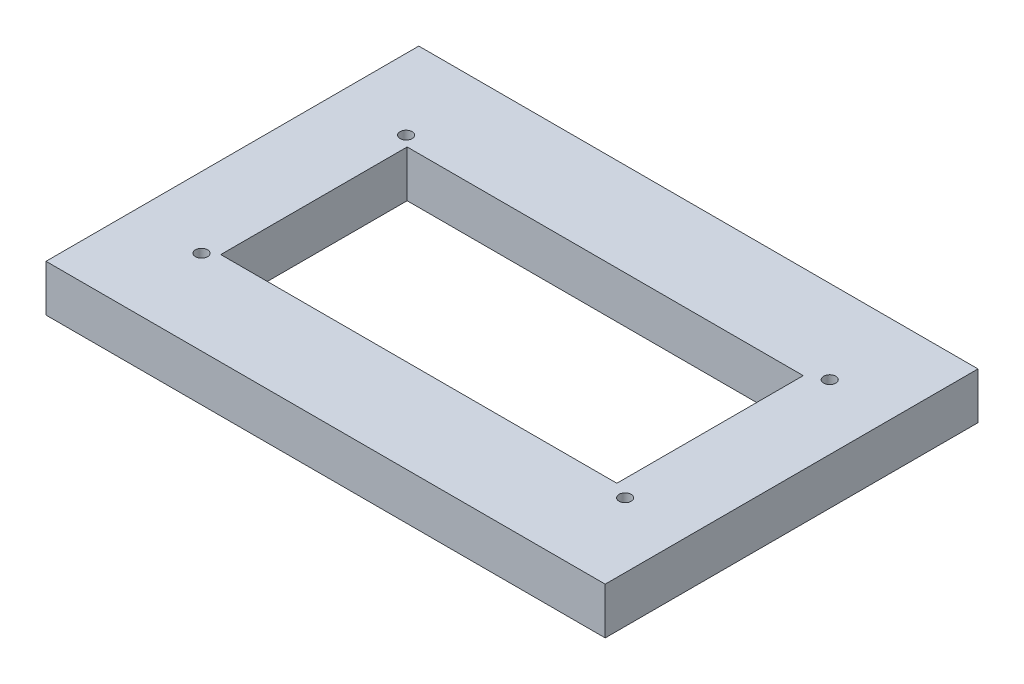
ISO-10303-21;
HEADER;
FILE_DESCRIPTION(('STEP AP214'),'2;1');
FILE_NAME('part.step','',(''),(''),'','','');
FILE_SCHEMA(('AUTOMOTIVE_DESIGN { 1 0 10303 214 1 1 1 1 }'));
ENDSEC;
DATA;
#1=APPLICATION_CONTEXT('core data for automotive mechanical design processes');
#2=APPLICATION_PROTOCOL_DEFINITION('international standard','automotive_design',2000,#1);
#3=PRODUCT_CONTEXT('',#1,'mechanical');
#4=PRODUCT('Part','Part','',(#3));
#5=PRODUCT_RELATED_PRODUCT_CATEGORY('part','',(#4));
#6=PRODUCT_DEFINITION_FORMATION('','',#4);
#7=PRODUCT_DEFINITION_CONTEXT('part definition',#1,'design');
#8=PRODUCT_DEFINITION('design','',#6,#7);
#9=PRODUCT_DEFINITION_SHAPE('','',#8);
#10=(LENGTH_UNIT() NAMED_UNIT(*) SI_UNIT(.MILLI.,.METRE.));
#11=(NAMED_UNIT(*) PLANE_ANGLE_UNIT() SI_UNIT($,.RADIAN.));
#12=(NAMED_UNIT(*) SI_UNIT($,.STERADIAN.) SOLID_ANGLE_UNIT());
#13=UNCERTAINTY_MEASURE_WITH_UNIT(LENGTH_MEASURE(1.E-05),#10,'distance_accuracy_value','');
#14=(GEOMETRIC_REPRESENTATION_CONTEXT(3) GLOBAL_UNCERTAINTY_ASSIGNED_CONTEXT((#13)) GLOBAL_UNIT_ASSIGNED_CONTEXT((#10,
#11,#12)) REPRESENTATION_CONTEXT('',''));
#15=CARTESIAN_POINT('',(0.,0.,0.));
#16=DIRECTION('',(0.,0.,1.));
#17=DIRECTION('',(1.,0.,0.));
#18=AXIS2_PLACEMENT_3D('',#15,#16,#17);
#19=CARTESIAN_POINT('',(152.4,25.4,-101.6));
#20=DIRECTION('',(-1.,0.,0.));
#21=DIRECTION('',(0.,0.,1.));
#22=AXIS2_PLACEMENT_3D('',#19,#20,#21);
#23=PLANE('',#22);
#24=DIRECTION('',(0.,0.,-1.));
#25=VECTOR('',#24,1.);
#26=CARTESIAN_POINT('',(152.4,0.,-101.6));
#27=LINE('',#26,#25);
#28=CARTESIAN_POINT('',(152.4,0.,101.6));
#29=VERTEX_POINT('',#28);
#30=CARTESIAN_POINT('',(152.4,0.,-101.6));
#31=VERTEX_POINT('',#30);
#32=EDGE_CURVE('E134',#29,#31,#27,.T.);
#33=ORIENTED_EDGE('',*,*,#32,.T.);
#34=DIRECTION('',(0.,-1.,0.));
#35=VECTOR('',#34,1.);
#36=CARTESIAN_POINT('',(152.4,25.4,-101.6));
#37=LINE('',#36,#35);
#38=CARTESIAN_POINT('',(152.4,25.4,-101.6));
#39=VERTEX_POINT('',#38);
#40=EDGE_CURVE('E11',#39,#31,#37,.T.);
#41=ORIENTED_EDGE('',*,*,#40,.F.);
#42=DIRECTION('',(0.,0.,-1.));
#43=VECTOR('',#42,1.);
#44=CARTESIAN_POINT('',(152.4,25.4,-101.6));
#45=LINE('',#44,#43);
#46=CARTESIAN_POINT('',(152.4,25.4,101.6));
#47=VERTEX_POINT('',#46);
#48=EDGE_CURVE('E138',#47,#39,#45,.T.);
#49=ORIENTED_EDGE('',*,*,#48,.F.);
#50=DIRECTION('',(0.,-1.,0.));
#51=VECTOR('',#50,1.);
#52=CARTESIAN_POINT('',(152.4,25.4,101.6));
#53=LINE('',#52,#51);
#54=EDGE_CURVE('E148',#47,#29,#53,.T.);
#55=ORIENTED_EDGE('',*,*,#54,.T.);
#56=EDGE_LOOP('',(#33,#41,#49,#55));
#57=FACE_BOUND('',#56,.T.);
#58=ADVANCED_FACE('F33',(#57),#23,.F.);
#59=CARTESIAN_POINT('',(-152.4,25.4,-101.6));
#60=DIRECTION('',(0.,0.,1.));
#61=DIRECTION('',(1.,0.,0.));
#62=AXIS2_PLACEMENT_3D('',#59,#60,#61);
#63=PLANE('',#62);
#64=DIRECTION('',(-1.,0.,0.));
#65=VECTOR('',#64,1.);
#66=CARTESIAN_POINT('',(-152.4,0.,-101.6));
#67=LINE('',#66,#65);
#68=CARTESIAN_POINT('',(-152.4,0.,-101.6));
#69=VERTEX_POINT('',#68);
#70=EDGE_CURVE('E151',#31,#69,#67,.T.);
#71=ORIENTED_EDGE('',*,*,#70,.T.);
#72=DIRECTION('',(0.,-1.,0.));
#73=VECTOR('',#72,1.);
#74=CARTESIAN_POINT('',(-152.4,25.4,-101.6));
#75=LINE('',#74,#73);
#76=CARTESIAN_POINT('',(-152.4,25.4,-101.6));
#77=VERTEX_POINT('',#76);
#78=EDGE_CURVE('E40',#77,#69,#75,.T.);
#79=ORIENTED_EDGE('',*,*,#78,.F.);
#80=DIRECTION('',(-1.,0.,0.));
#81=VECTOR('',#80,1.);
#82=CARTESIAN_POINT('',(-152.4,25.4,-101.6));
#83=LINE('',#82,#81);
#84=EDGE_CURVE('E141',#39,#77,#83,.T.);
#85=ORIENTED_EDGE('',*,*,#84,.F.);
#86=ORIENTED_EDGE('',*,*,#40,.T.);
#87=EDGE_LOOP('',(#71,#79,#85,#86));
#88=FACE_BOUND('',#87,.T.);
#89=ADVANCED_FACE('F179',(#88),#63,.F.);
#90=CARTESIAN_POINT('',(-152.4,25.4,-101.6));
#91=DIRECTION('',(1.,0.,0.));
#92=DIRECTION('',(0.,0.,-1.));
#93=AXIS2_PLACEMENT_3D('',#90,#91,#92);
#94=PLANE('',#93);
#95=DIRECTION('',(0.,0.,1.));
#96=VECTOR('',#95,1.);
#97=CARTESIAN_POINT('',(-152.4,0.,-101.6));
#98=LINE('',#97,#96);
#99=CARTESIAN_POINT('',(-152.4,0.,101.6));
#100=VERTEX_POINT('',#99);
#101=EDGE_CURVE('E153',#69,#100,#98,.T.);
#102=ORIENTED_EDGE('',*,*,#101,.T.);
#103=DIRECTION('',(0.,-1.,0.));
#104=VECTOR('',#103,1.);
#105=CARTESIAN_POINT('',(-152.4,25.4,101.6));
#106=LINE('',#105,#104);
#107=CARTESIAN_POINT('',(-152.4,25.4,101.6));
#108=VERTEX_POINT('',#107);
#109=EDGE_CURVE('E158',#108,#100,#106,.T.);
#110=ORIENTED_EDGE('',*,*,#109,.F.);
#111=DIRECTION('',(0.,0.,1.));
#112=VECTOR('',#111,1.);
#113=CARTESIAN_POINT('',(-152.4,25.4,-101.6));
#114=LINE('',#113,#112);
#115=EDGE_CURVE('E144',#77,#108,#114,.T.);
#116=ORIENTED_EDGE('',*,*,#115,.F.);
#117=ORIENTED_EDGE('',*,*,#78,.T.);
#118=EDGE_LOOP('',(#102,#110,#116,#117));
#119=FACE_BOUND('',#118,.T.);
#120=ADVANCED_FACE('F165',(#119),#94,.F.);
#121=CARTESIAN_POINT('',(-152.4,25.4,101.6));
#122=DIRECTION('',(0.,0.,-1.));
#123=DIRECTION('',(-1.,0.,0.));
#124=AXIS2_PLACEMENT_3D('',#121,#122,#123);
#125=PLANE('',#124);
#126=DIRECTION('',(1.,0.,0.));
#127=VECTOR('',#126,1.);
#128=CARTESIAN_POINT('',(-152.4,0.,101.6));
#129=LINE('',#128,#127);
#130=EDGE_CURVE('E142',#100,#29,#129,.T.);
#131=ORIENTED_EDGE('',*,*,#130,.T.);
#132=ORIENTED_EDGE('',*,*,#54,.F.);
#133=DIRECTION('',(1.,0.,0.));
#134=VECTOR('',#133,1.);
#135=CARTESIAN_POINT('',(-152.4,25.4,101.6));
#136=LINE('',#135,#134);
#137=EDGE_CURVE('E146',#108,#47,#136,.T.);
#138=ORIENTED_EDGE('',*,*,#137,.F.);
#139=ORIENTED_EDGE('',*,*,#109,.T.);
#140=EDGE_LOOP('',(#131,#132,#138,#139));
#141=FACE_BOUND('',#140,.T.);
#142=ADVANCED_FACE('F172',(#141),#125,.F.);
#143=CARTESIAN_POINT('',(0.,25.4,0.));
#144=DIRECTION('',(0.,1.,0.));
#145=DIRECTION('',(0.,0.,1.));
#146=AXIS2_PLACEMENT_3D('',#143,#144,#145);
#147=PLANE('',#146);
#148=CARTESIAN_POINT('',(117.071822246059,25.4,-56.1041996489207));
#149=DIRECTION('',(0.,1.,0.));
#150=DIRECTION('',(0.,0.,1.));
#151=AXIS2_PLACEMENT_3D('',#148,#149,#150);
#152=CIRCLE('',#151,3.3);
#153=CARTESIAN_POINT('',(117.071822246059,25.4,-52.8041996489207));
#154=VERTEX_POINT('',#153);
#155=EDGE_CURVE('E229',#154,#154,#152,.T.);
#156=ORIENTED_EDGE('',*,*,#155,.F.);
#157=EDGE_LOOP('',(#156));
#158=FACE_BOUND('',#157,.T.);
#159=CARTESIAN_POINT('',(117.071822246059,25.4,55.4092570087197));
#160=DIRECTION('',(0.,1.,0.));
#161=DIRECTION('',(0.,0.,1.));
#162=AXIS2_PLACEMENT_3D('',#159,#160,#161);
#163=CIRCLE('',#162,3.3);
#164=CARTESIAN_POINT('',(117.071822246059,25.4,58.7092570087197));
#165=VERTEX_POINT('',#164);
#166=EDGE_CURVE('E231',#165,#165,#163,.T.);
#167=ORIENTED_EDGE('',*,*,#166,.F.);
#168=EDGE_LOOP('',(#167));
#169=FACE_BOUND('',#168,.T.);
#170=CARTESIAN_POINT('',(-113.812107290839,25.4,55.4092570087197));
#171=DIRECTION('',(0.,1.,0.));
#172=DIRECTION('',(0.,0.,1.));
#173=AXIS2_PLACEMENT_3D('',#170,#171,#172);
#174=CIRCLE('',#173,3.30000000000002);
#175=CARTESIAN_POINT('',(-113.812107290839,25.4,58.7092570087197));
#176=VERTEX_POINT('',#175);
#177=EDGE_CURVE('E237',#176,#176,#174,.T.);
#178=ORIENTED_EDGE('',*,*,#177,.F.);
#179=EDGE_LOOP('',(#178));
#180=FACE_BOUND('',#179,.T.);
#181=CARTESIAN_POINT('',(-113.812107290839,25.4,-56.1041996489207));
#182=DIRECTION('',(0.,1.,0.));
#183=DIRECTION('',(0.,0.,1.));
#184=AXIS2_PLACEMENT_3D('',#181,#182,#183);
#185=CIRCLE('',#184,3.30000000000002);
#186=CARTESIAN_POINT('',(-113.812107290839,25.4,-52.8041996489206));
#187=VERTEX_POINT('',#186);
#188=EDGE_CURVE('E121',#187,#187,#185,.T.);
#189=ORIENTED_EDGE('',*,*,#188,.F.);
#190=EDGE_LOOP('',(#189));
#191=FACE_BOUND('',#190,.T.);
#192=DIRECTION('',(0.,0.,-1.));
#193=VECTOR('',#192,1.);
#194=CARTESIAN_POINT('',(107.95,25.4,-50.8));
#195=LINE('',#194,#193);
#196=CARTESIAN_POINT('',(107.95,25.4,50.8));
#197=VERTEX_POINT('',#196);
#198=CARTESIAN_POINT('',(107.95,25.4,-50.8));
#199=VERTEX_POINT('',#198);
#200=EDGE_CURVE('E47',#197,#199,#195,.T.);
#201=ORIENTED_EDGE('',*,*,#200,.F.);
#202=DIRECTION('',(1.,0.,0.));
#203=VECTOR('',#202,1.);
#204=CARTESIAN_POINT('',(-107.95,25.4,50.8));
#205=LINE('',#204,#203);
#206=CARTESIAN_POINT('',(-107.95,25.4,50.8));
#207=VERTEX_POINT('',#206);
#208=EDGE_CURVE('E115',#207,#197,#205,.T.);
#209=ORIENTED_EDGE('',*,*,#208,.F.);
#210=DIRECTION('',(0.,0.,1.));
#211=VECTOR('',#210,1.);
#212=CARTESIAN_POINT('',(-107.95,25.4,-50.8));
#213=LINE('',#212,#211);
#214=CARTESIAN_POINT('',(-107.95,25.4,-50.8));
#215=VERTEX_POINT('',#214);
#216=EDGE_CURVE('E118',#215,#207,#213,.T.);
#217=ORIENTED_EDGE('',*,*,#216,.F.);
#218=DIRECTION('',(-1.,0.,0.));
#219=VECTOR('',#218,1.);
#220=CARTESIAN_POINT('',(-107.95,25.4,-50.8));
#221=LINE('',#220,#219);
#222=EDGE_CURVE('E127',#199,#215,#221,.T.);
#223=ORIENTED_EDGE('',*,*,#222,.F.);
#224=EDGE_LOOP('',(#201,#209,#217,#223));
#225=FACE_BOUND('',#224,.T.);
#226=ORIENTED_EDGE('',*,*,#48,.T.);
#227=ORIENTED_EDGE('',*,*,#84,.T.);
#228=ORIENTED_EDGE('',*,*,#115,.T.);
#229=ORIENTED_EDGE('',*,*,#137,.T.);
#230=EDGE_LOOP('',(#226,#227,#228,#229));
#231=FACE_BOUND('',#230,.T.);
#232=ADVANCED_FACE('F178',(#158,#169,#180,#191,#225,#231),#147,.T.);
#233=CARTESIAN_POINT('',(0.,0.,0.));
#234=DIRECTION('',(0.,1.,0.));
#235=DIRECTION('',(0.,0.,1.));
#236=AXIS2_PLACEMENT_3D('',#233,#234,#235);
#237=PLANE('',#236);
#238=CARTESIAN_POINT('',(117.071822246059,0.,-56.1041996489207));
#239=DIRECTION('',(0.,1.,0.));
#240=DIRECTION('',(0.,0.,1.));
#241=AXIS2_PLACEMENT_3D('',#238,#239,#240);
#242=CIRCLE('',#241,3.3);
#243=CARTESIAN_POINT('',(117.071822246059,0.,-52.8041996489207));
#244=VERTEX_POINT('',#243);
#245=EDGE_CURVE('E226',#244,#244,#242,.T.);
#246=ORIENTED_EDGE('',*,*,#245,.T.);
#247=EDGE_LOOP('',(#246));
#248=FACE_BOUND('',#247,.T.);
#249=CARTESIAN_POINT('',(117.071822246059,0.,55.4092570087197));
#250=DIRECTION('',(0.,1.,0.));
#251=DIRECTION('',(0.,0.,1.));
#252=AXIS2_PLACEMENT_3D('',#249,#250,#251);
#253=CIRCLE('',#252,3.3);
#254=CARTESIAN_POINT('',(117.071822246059,0.,58.7092570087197));
#255=VERTEX_POINT('',#254);
#256=EDGE_CURVE('E234',#255,#255,#253,.T.);
#257=ORIENTED_EDGE('',*,*,#256,.T.);
#258=EDGE_LOOP('',(#257));
#259=FACE_BOUND('',#258,.T.);
#260=CARTESIAN_POINT('',(-113.812107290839,0.,55.4092570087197));
#261=DIRECTION('',(0.,1.,0.));
#262=DIRECTION('',(0.,0.,1.));
#263=AXIS2_PLACEMENT_3D('',#260,#261,#262);
#264=CIRCLE('',#263,3.30000000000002);
#265=CARTESIAN_POINT('',(-113.812107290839,0.,58.7092570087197));
#266=VERTEX_POINT('',#265);
#267=EDGE_CURVE('E240',#266,#266,#264,.T.);
#268=ORIENTED_EDGE('',*,*,#267,.T.);
#269=EDGE_LOOP('',(#268));
#270=FACE_BOUND('',#269,.T.);
#271=CARTESIAN_POINT('',(-113.812107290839,0.,-56.1041996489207));
#272=DIRECTION('',(0.,1.,0.));
#273=DIRECTION('',(0.,0.,1.));
#274=AXIS2_PLACEMENT_3D('',#271,#272,#273);
#275=CIRCLE('',#274,3.30000000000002);
#276=CARTESIAN_POINT('',(-113.812107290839,0.,-52.8041996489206));
#277=VERTEX_POINT('',#276);
#278=EDGE_CURVE('E128',#277,#277,#275,.T.);
#279=ORIENTED_EDGE('',*,*,#278,.T.);
#280=EDGE_LOOP('',(#279));
#281=FACE_BOUND('',#280,.T.);
#282=DIRECTION('',(1.,0.,0.));
#283=VECTOR('',#282,1.);
#284=CARTESIAN_POINT('',(-107.95,0.,50.8));
#285=LINE('',#284,#283);
#286=CARTESIAN_POINT('',(-107.95,0.,50.8));
#287=VERTEX_POINT('',#286);
#288=CARTESIAN_POINT('',(107.95,0.,50.8));
#289=VERTEX_POINT('',#288);
#290=EDGE_CURVE('E105',#287,#289,#285,.T.);
#291=ORIENTED_EDGE('',*,*,#290,.T.);
#292=DIRECTION('',(0.,0.,-1.));
#293=VECTOR('',#292,1.);
#294=CARTESIAN_POINT('',(107.95,0.,-50.8));
#295=LINE('',#294,#293);
#296=CARTESIAN_POINT('',(107.95,0.,-50.8));
#297=VERTEX_POINT('',#296);
#298=EDGE_CURVE('E99',#289,#297,#295,.T.);
#299=ORIENTED_EDGE('',*,*,#298,.T.);
#300=DIRECTION('',(-1.,0.,0.));
#301=VECTOR('',#300,1.);
#302=CARTESIAN_POINT('',(-107.95,0.,-50.8));
#303=LINE('',#302,#301);
#304=CARTESIAN_POINT('',(-107.95,0.,-50.8));
#305=VERTEX_POINT('',#304);
#306=EDGE_CURVE('E108',#297,#305,#303,.T.);
#307=ORIENTED_EDGE('',*,*,#306,.T.);
#308=DIRECTION('',(0.,0.,1.));
#309=VECTOR('',#308,1.);
#310=CARTESIAN_POINT('',(-107.95,0.,-50.8));
#311=LINE('',#310,#309);
#312=EDGE_CURVE('E55',#305,#287,#311,.T.);
#313=ORIENTED_EDGE('',*,*,#312,.T.);
#314=EDGE_LOOP('',(#291,#299,#307,#313));
#315=FACE_BOUND('',#314,.T.);
#316=ORIENTED_EDGE('',*,*,#32,.F.);
#317=ORIENTED_EDGE('',*,*,#130,.F.);
#318=ORIENTED_EDGE('',*,*,#101,.F.);
#319=ORIENTED_EDGE('',*,*,#70,.F.);
#320=EDGE_LOOP('',(#316,#317,#318,#319));
#321=FACE_BOUND('',#320,.T.);
#322=ADVANCED_FACE('F112',(#248,#259,#270,#281,#315,#321),#237,.F.);
#323=CARTESIAN_POINT('',(107.95,0.,-50.8));
#324=DIRECTION('',(1.,0.,0.));
#325=DIRECTION('',(0.,0.,-1.));
#326=AXIS2_PLACEMENT_3D('',#323,#324,#325);
#327=PLANE('',#326);
#328=ORIENTED_EDGE('',*,*,#200,.T.);
#329=DIRECTION('',(0.,1.,0.));
#330=VECTOR('',#329,1.);
#331=CARTESIAN_POINT('',(107.95,0.,-50.8));
#332=LINE('',#331,#330);
#333=EDGE_CURVE('E95',#297,#199,#332,.T.);
#334=ORIENTED_EDGE('',*,*,#333,.F.);
#335=ORIENTED_EDGE('',*,*,#298,.F.);
#336=DIRECTION('',(0.,1.,0.));
#337=VECTOR('',#336,1.);
#338=CARTESIAN_POINT('',(107.95,0.,50.8));
#339=LINE('',#338,#337);
#340=EDGE_CURVE('E132',#289,#197,#339,.T.);
#341=ORIENTED_EDGE('',*,*,#340,.T.);
#342=EDGE_LOOP('',(#328,#334,#335,#341));
#343=FACE_BOUND('',#342,.T.);
#344=ADVANCED_FACE('F97',(#343),#327,.F.);
#345=CARTESIAN_POINT('',(-107.95,0.,50.8));
#346=DIRECTION('',(0.,0.,1.));
#347=DIRECTION('',(1.,0.,0.));
#348=AXIS2_PLACEMENT_3D('',#345,#346,#347);
#349=PLANE('',#348);
#350=ORIENTED_EDGE('',*,*,#208,.T.);
#351=ORIENTED_EDGE('',*,*,#340,.F.);
#352=ORIENTED_EDGE('',*,*,#290,.F.);
#353=DIRECTION('',(0.,1.,0.));
#354=VECTOR('',#353,1.);
#355=CARTESIAN_POINT('',(-107.95,0.,50.8));
#356=LINE('',#355,#354);
#357=EDGE_CURVE('E135',#287,#207,#356,.T.);
#358=ORIENTED_EDGE('',*,*,#357,.T.);
#359=EDGE_LOOP('',(#350,#351,#352,#358));
#360=FACE_BOUND('',#359,.T.);
#361=ADVANCED_FACE('F197',(#360),#349,.F.);
#362=CARTESIAN_POINT('',(-107.95,0.,-50.8));
#363=DIRECTION('',(-1.,0.,0.));
#364=DIRECTION('',(0.,0.,1.));
#365=AXIS2_PLACEMENT_3D('',#362,#363,#364);
#366=PLANE('',#365);
#367=ORIENTED_EDGE('',*,*,#216,.T.);
#368=ORIENTED_EDGE('',*,*,#357,.F.);
#369=ORIENTED_EDGE('',*,*,#312,.F.);
#370=DIRECTION('',(0.,1.,0.));
#371=VECTOR('',#370,1.);
#372=CARTESIAN_POINT('',(-107.95,0.,-50.8));
#373=LINE('',#372,#371);
#374=EDGE_CURVE('E104',#305,#215,#373,.T.);
#375=ORIENTED_EDGE('',*,*,#374,.T.);
#376=EDGE_LOOP('',(#367,#368,#369,#375));
#377=FACE_BOUND('',#376,.T.);
#378=ADVANCED_FACE('F201',(#377),#366,.F.);
#379=CARTESIAN_POINT('',(-107.95,0.,-50.8));
#380=DIRECTION('',(0.,0.,-1.));
#381=DIRECTION('',(-1.,0.,0.));
#382=AXIS2_PLACEMENT_3D('',#379,#380,#381);
#383=PLANE('',#382);
#384=ORIENTED_EDGE('',*,*,#222,.T.);
#385=ORIENTED_EDGE('',*,*,#374,.F.);
#386=ORIENTED_EDGE('',*,*,#306,.F.);
#387=ORIENTED_EDGE('',*,*,#333,.T.);
#388=EDGE_LOOP('',(#384,#385,#386,#387));
#389=FACE_BOUND('',#388,.T.);
#390=ADVANCED_FACE('F109',(#389),#383,.F.);
#391=CARTESIAN_POINT('',(-113.812107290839,0.,-56.1041996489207));
#392=DIRECTION('',(0.,1.,0.));
#393=DIRECTION('',(0.,0.,1.));
#394=AXIS2_PLACEMENT_3D('',#391,#392,#393);
#395=CYLINDRICAL_SURFACE('',#394,3.30000000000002);
#396=ORIENTED_EDGE('',*,*,#278,.F.);
#397=EDGE_LOOP('',(#396));
#398=FACE_BOUND('',#397,.T.);
#399=ORIENTED_EDGE('',*,*,#188,.T.);
#400=EDGE_LOOP('',(#399));
#401=FACE_BOUND('',#400,.T.);
#402=ADVANCED_FACE('F200',(#398,#401),#395,.F.);
#403=CARTESIAN_POINT('',(-113.812107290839,0.,55.4092570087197));
#404=DIRECTION('',(0.,1.,0.));
#405=DIRECTION('',(0.,0.,1.));
#406=AXIS2_PLACEMENT_3D('',#403,#404,#405);
#407=CYLINDRICAL_SURFACE('',#406,3.30000000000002);
#408=ORIENTED_EDGE('',*,*,#267,.F.);
#409=EDGE_LOOP('',(#408));
#410=FACE_BOUND('',#409,.T.);
#411=ORIENTED_EDGE('',*,*,#177,.T.);
#412=EDGE_LOOP('',(#411));
#413=FACE_BOUND('',#412,.T.);
#414=ADVANCED_FACE('F209',(#410,#413),#407,.F.);
#415=CARTESIAN_POINT('',(117.071822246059,0.,55.4092570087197));
#416=DIRECTION('',(0.,1.,0.));
#417=DIRECTION('',(0.,0.,1.));
#418=AXIS2_PLACEMENT_3D('',#415,#416,#417);
#419=CYLINDRICAL_SURFACE('',#418,3.3);
#420=ORIENTED_EDGE('',*,*,#256,.F.);
#421=EDGE_LOOP('',(#420));
#422=FACE_BOUND('',#421,.T.);
#423=ORIENTED_EDGE('',*,*,#166,.T.);
#424=EDGE_LOOP('',(#423));
#425=FACE_BOUND('',#424,.T.);
#426=ADVANCED_FACE('F213',(#422,#425),#419,.F.);
#427=CARTESIAN_POINT('',(117.071822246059,0.,-56.1041996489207));
#428=DIRECTION('',(0.,1.,0.));
#429=DIRECTION('',(0.,0.,1.));
#430=AXIS2_PLACEMENT_3D('',#427,#428,#429);
#431=CYLINDRICAL_SURFACE('',#430,3.3);
#432=ORIENTED_EDGE('',*,*,#245,.F.);
#433=EDGE_LOOP('',(#432));
#434=FACE_BOUND('',#433,.T.);
#435=ORIENTED_EDGE('',*,*,#155,.T.);
#436=EDGE_LOOP('',(#435));
#437=FACE_BOUND('',#436,.T.);
#438=ADVANCED_FACE('F217',(#434,#437),#431,.F.);
#439=CLOSED_SHELL('',(#58,#89,#120,#142,#232,#322,#344,#361,#378,#390,#402,#414,#426,#438));
#440=MANIFOLD_SOLID_BREP('B2',#439);
#441=ADVANCED_BREP_SHAPE_REPRESENTATION('',(#18,#440),#14);
#442=SHAPE_DEFINITION_REPRESENTATION(#9,#441);
ENDSEC;
END-ISO-10303-21;
